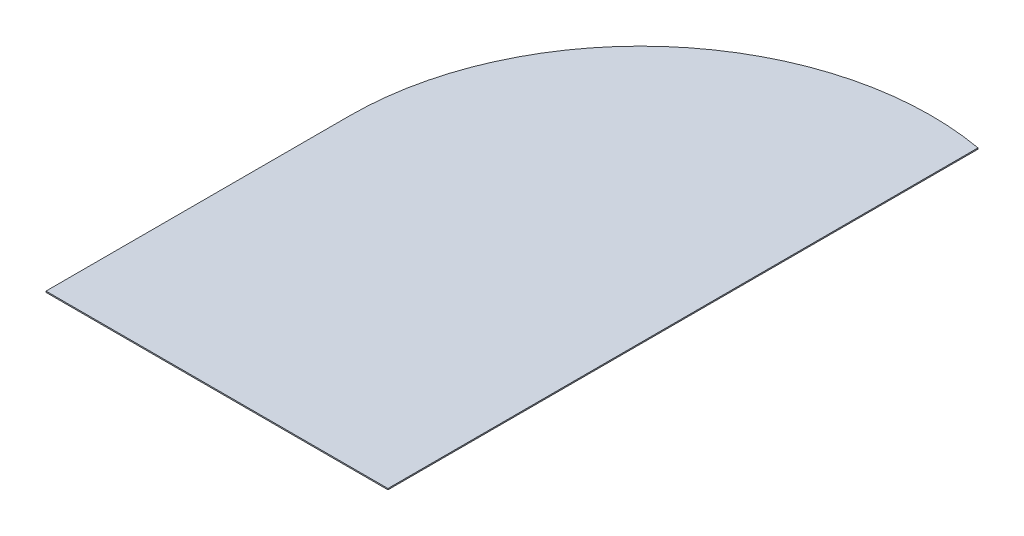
ISO-10303-21;
HEADER;
FILE_DESCRIPTION(('STEP AP214'),'2;1');
FILE_NAME('part.step','',(''),(''),'','','');
FILE_SCHEMA(('AUTOMOTIVE_DESIGN { 1 0 10303 214 1 1 1 1 }'));
ENDSEC;
DATA;
#1=APPLICATION_CONTEXT('core data for automotive mechanical design processes');
#2=APPLICATION_PROTOCOL_DEFINITION('international standard','automotive_design',2000,#1);
#3=PRODUCT_CONTEXT('',#1,'mechanical');
#4=PRODUCT('Part','Part','',(#3));
#5=PRODUCT_RELATED_PRODUCT_CATEGORY('part','',(#4));
#6=PRODUCT_DEFINITION_FORMATION('','',#4);
#7=PRODUCT_DEFINITION_CONTEXT('part definition',#1,'design');
#8=PRODUCT_DEFINITION('design','',#6,#7);
#9=PRODUCT_DEFINITION_SHAPE('','',#8);
#10=(LENGTH_UNIT() NAMED_UNIT(*) SI_UNIT(.MILLI.,.METRE.));
#11=(NAMED_UNIT(*) PLANE_ANGLE_UNIT() SI_UNIT($,.RADIAN.));
#12=(NAMED_UNIT(*) SI_UNIT($,.STERADIAN.) SOLID_ANGLE_UNIT());
#13=UNCERTAINTY_MEASURE_WITH_UNIT(LENGTH_MEASURE(1.E-05),#10,'distance_accuracy_value','');
#14=(GEOMETRIC_REPRESENTATION_CONTEXT(3) GLOBAL_UNCERTAINTY_ASSIGNED_CONTEXT((#13)) GLOBAL_UNIT_ASSIGNED_CONTEXT((#10,
#11,#12)) REPRESENTATION_CONTEXT('',''));
#15=CARTESIAN_POINT('',(0.,0.,0.));
#16=DIRECTION('',(0.,0.,1.));
#17=DIRECTION('',(1.,0.,0.));
#18=AXIS2_PLACEMENT_3D('',#15,#16,#17);
#19=CARTESIAN_POINT('',(0.,0.7874,-391.387984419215));
#20=DIRECTION('',(-1.,0.,0.));
#21=DIRECTION('',(0.,0.,1.));
#22=AXIS2_PLACEMENT_3D('',#19,#20,#21);
#23=PLANE('',#22);
#24=DIRECTION('',(0.,0.,-1.));
#25=VECTOR('',#24,1.);
#26=CARTESIAN_POINT('',(0.,0.,-391.387984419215));
#27=LINE('',#26,#25);
#28=CARTESIAN_POINT('',(0.,0.,0.));
#29=VERTEX_POINT('',#28);
#30=CARTESIAN_POINT('',(0.,0.,-391.387984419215));
#31=VERTEX_POINT('',#30);
#32=EDGE_CURVE('E96',#29,#31,#27,.T.);
#33=ORIENTED_EDGE('',*,*,#32,.T.);
#34=DIRECTION('',(0.,-1.,0.));
#35=VECTOR('',#34,1.);
#36=CARTESIAN_POINT('',(0.,0.7874,-391.387984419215));
#37=LINE('',#36,#35);
#38=CARTESIAN_POINT('',(0.,0.7874,-391.387984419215));
#39=VERTEX_POINT('',#38);
#40=EDGE_CURVE('E11',#39,#31,#37,.T.);
#41=ORIENTED_EDGE('',*,*,#40,.F.);
#42=DIRECTION('',(0.,0.,-1.));
#43=VECTOR('',#42,1.);
#44=CARTESIAN_POINT('',(0.,0.7874,-391.387984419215));
#45=LINE('',#44,#43);
#46=CARTESIAN_POINT('',(0.,0.7874,0.));
#47=VERTEX_POINT('',#46);
#48=EDGE_CURVE('E84',#47,#39,#45,.T.);
#49=ORIENTED_EDGE('',*,*,#48,.F.);
#50=DIRECTION('',(0.,-1.,0.));
#51=VECTOR('',#50,1.);
#52=CARTESIAN_POINT('',(0.,0.7874,0.));
#53=LINE('',#52,#51);
#54=EDGE_CURVE('E92',#47,#29,#53,.T.);
#55=ORIENTED_EDGE('',*,*,#54,.T.);
#56=EDGE_LOOP('',(#33,#41,#49,#55));
#57=FACE_BOUND('',#56,.T.);
#58=ADVANCED_FACE('F33',(#57),#23,.F.);
#59=CARTESIAN_POINT('',(-33.9624622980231,0.7874,-201.515356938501));
#60=DIRECTION('',(0.,-1.,0.));
#61=DIRECTION('',(0.,0.,-1.));
#62=AXIS2_PLACEMENT_3D('',#59,#60,#61);
#63=CYLINDRICAL_SURFACE('',#62,192.886141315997);
#64=CARTESIAN_POINT('',(-33.9624622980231,0.,-201.515356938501));
#65=DIRECTION('',(0.,1.,0.));
#66=DIRECTION('',(0.,0.,-1.));
#67=AXIS2_PLACEMENT_3D('',#64,#65,#66);
#68=CIRCLE('',#67,192.886141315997);
#69=CARTESIAN_POINT('',(-226.84860361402,0.,-201.515356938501));
#70=VERTEX_POINT('',#69);
#71=EDGE_CURVE('E88',#31,#70,#68,.T.);
#72=ORIENTED_EDGE('',*,*,#71,.T.);
#73=DIRECTION('',(0.,-1.,0.));
#74=VECTOR('',#73,1.);
#75=CARTESIAN_POINT('',(-226.84860361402,0.7874,-201.515356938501));
#76=LINE('',#75,#74);
#77=CARTESIAN_POINT('',(-226.84860361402,0.7874,-201.515356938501));
#78=VERTEX_POINT('',#77);
#79=EDGE_CURVE('E41',#78,#70,#76,.T.);
#80=ORIENTED_EDGE('',*,*,#79,.F.);
#81=CARTESIAN_POINT('',(-33.9624622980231,0.7874,-201.515356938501));
#82=DIRECTION('',(0.,1.,0.));
#83=DIRECTION('',(0.,0.,-1.));
#84=AXIS2_PLACEMENT_3D('',#81,#82,#83);
#85=CIRCLE('',#84,192.886141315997);
#86=EDGE_CURVE('E79',#39,#78,#85,.T.);
#87=ORIENTED_EDGE('',*,*,#86,.F.);
#88=ORIENTED_EDGE('',*,*,#40,.T.);
#89=EDGE_LOOP('',(#72,#80,#87,#88));
#90=FACE_BOUND('',#89,.T.);
#91=ADVANCED_FACE('F87',(#90),#63,.T.);
#92=CARTESIAN_POINT('',(-226.84860361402,0.7874,0.));
#93=DIRECTION('',(1.,0.,0.));
#94=DIRECTION('',(0.,0.,-1.));
#95=AXIS2_PLACEMENT_3D('',#92,#93,#94);
#96=PLANE('',#95);
#97=DIRECTION('',(0.,0.,1.));
#98=VECTOR('',#97,1.);
#99=CARTESIAN_POINT('',(-226.84860361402,0.,0.));
#100=LINE('',#99,#98);
#101=CARTESIAN_POINT('',(-226.84860361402,0.,0.));
#102=VERTEX_POINT('',#101);
#103=EDGE_CURVE('E66',#70,#102,#100,.T.);
#104=ORIENTED_EDGE('',*,*,#103,.T.);
#105=DIRECTION('',(0.,-1.,0.));
#106=VECTOR('',#105,1.);
#107=CARTESIAN_POINT('',(-226.84860361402,0.7874,0.));
#108=LINE('',#107,#106);
#109=CARTESIAN_POINT('',(-226.84860361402,0.7874,0.));
#110=VERTEX_POINT('',#109);
#111=EDGE_CURVE('E89',#110,#102,#108,.T.);
#112=ORIENTED_EDGE('',*,*,#111,.F.);
#113=DIRECTION('',(0.,0.,1.));
#114=VECTOR('',#113,1.);
#115=CARTESIAN_POINT('',(-226.84860361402,0.7874,0.));
#116=LINE('',#115,#114);
#117=EDGE_CURVE('E82',#78,#110,#116,.T.);
#118=ORIENTED_EDGE('',*,*,#117,.F.);
#119=ORIENTED_EDGE('',*,*,#79,.T.);
#120=EDGE_LOOP('',(#104,#112,#118,#119));
#121=FACE_BOUND('',#120,.T.);
#122=ADVANCED_FACE('F90',(#121),#96,.F.);
#123=CARTESIAN_POINT('',(0.,0.7874,0.));
#124=DIRECTION('',(0.,0.,-1.));
#125=DIRECTION('',(-1.,0.,0.));
#126=AXIS2_PLACEMENT_3D('',#123,#124,#125);
#127=PLANE('',#126);
#128=DIRECTION('',(1.,0.,0.));
#129=VECTOR('',#128,1.);
#130=CARTESIAN_POINT('',(0.,0.,0.));
#131=LINE('',#130,#129);
#132=EDGE_CURVE('E72',#102,#29,#131,.T.);
#133=ORIENTED_EDGE('',*,*,#132,.T.);
#134=ORIENTED_EDGE('',*,*,#54,.F.);
#135=DIRECTION('',(1.,0.,0.));
#136=VECTOR('',#135,1.);
#137=CARTESIAN_POINT('',(0.,0.7874,0.));
#138=LINE('',#137,#136);
#139=EDGE_CURVE('E49',#110,#47,#138,.T.);
#140=ORIENTED_EDGE('',*,*,#139,.F.);
#141=ORIENTED_EDGE('',*,*,#111,.T.);
#142=EDGE_LOOP('',(#133,#134,#140,#141));
#143=FACE_BOUND('',#142,.T.);
#144=ADVANCED_FACE('F103',(#143),#127,.F.);
#145=CARTESIAN_POINT('',(-33.9624622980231,0.7874,-201.515356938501));
#146=DIRECTION('',(0.,-1.,0.));
#147=DIRECTION('',(0.,0.,-1.));
#148=AXIS2_PLACEMENT_3D('',#145,#146,#147);
#149=PLANE('',#148);
#150=ORIENTED_EDGE('',*,*,#48,.T.);
#151=ORIENTED_EDGE('',*,*,#86,.T.);
#152=ORIENTED_EDGE('',*,*,#117,.T.);
#153=ORIENTED_EDGE('',*,*,#139,.T.);
#154=EDGE_LOOP('',(#150,#151,#152,#153));
#155=FACE_BOUND('',#154,.T.);
#156=ADVANCED_FACE('F80',(#155),#149,.F.);
#157=CARTESIAN_POINT('',(-33.9624622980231,0.,-201.515356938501));
#158=DIRECTION('',(0.,-1.,0.));
#159=DIRECTION('',(0.,0.,-1.));
#160=AXIS2_PLACEMENT_3D('',#157,#158,#159);
#161=PLANE('',#160);
#162=ORIENTED_EDGE('',*,*,#32,.F.);
#163=ORIENTED_EDGE('',*,*,#132,.F.);
#164=ORIENTED_EDGE('',*,*,#103,.F.);
#165=ORIENTED_EDGE('',*,*,#71,.F.);
#166=EDGE_LOOP('',(#162,#163,#164,#165));
#167=FACE_BOUND('',#166,.T.);
#168=ADVANCED_FACE('F106',(#167),#161,.T.);
#169=CLOSED_SHELL('',(#58,#91,#122,#144,#156,#168));
#170=MANIFOLD_SOLID_BREP('B2',#169);
#171=ADVANCED_BREP_SHAPE_REPRESENTATION('',(#18,#170),#14);
#172=SHAPE_DEFINITION_REPRESENTATION(#9,#171);
ENDSEC;
END-ISO-10303-21;
